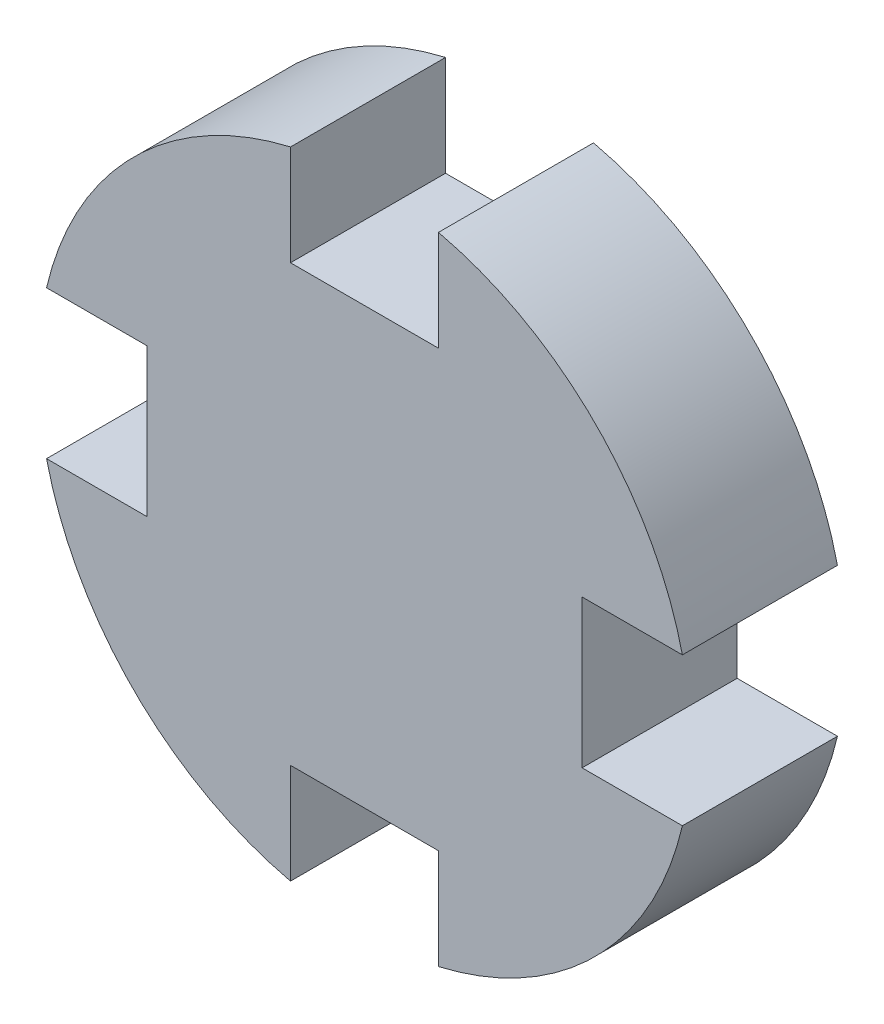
from build123d import *

# Parameters (mm, degrees)
SKETCH3_R           = 12
BOSS_EXTRUDE2_DEPTH = 5.7
SKETCH4_W           = 4
SKETCH4_H           = 5.44
CUT_EXTRUDE3_DEPTH  = 10
CIRPATTERN3_COUNT   = 4


with BuildPart() as part:
    # Sketch3 → Boss-Extrude2 (new body)
    with BuildSketch(Plane.XY):
        Circle(SKETCH3_R)
    extrude(amount=BOSS_EXTRUDE2_DEPTH)

    # Sketch4 → Cut-Extrude3 (cut)
    with BuildSketch(Plane.XY.offset(5.7)):
        with Locations((10, 0)):
            Rectangle(SKETCH4_W, SKETCH4_H)
    cut_extrude3 = extrude(amount=-CUT_EXTRUDE3_DEPTH, mode=Mode.SUBTRACT)

    # CirPattern3: Cut-Extrude3 ×4 about axis
    cirpattern3_axis = Axis((0, 0, 0), (0, 0, 1))
    for i in range(1, CIRPATTERN3_COUNT):
        add(cut_extrude3.rotate(cirpattern3_axis, i * 360 / CIRPATTERN3_COUNT), mode=Mode.SUBTRACT)


solid = part.part
